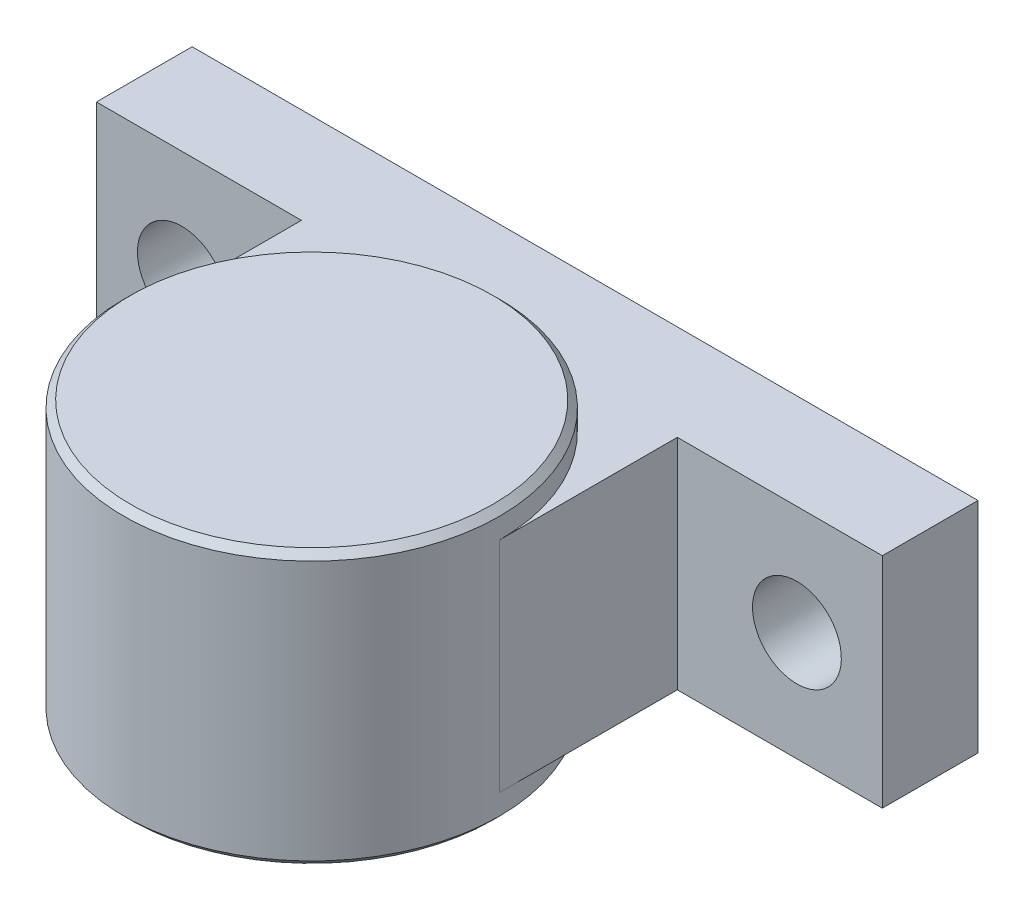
ISO-10303-21;
HEADER;
FILE_DESCRIPTION(('STEP AP214'),'2;1');
FILE_NAME('part.step','',(''),(''),'','','');
FILE_SCHEMA(('AUTOMOTIVE_DESIGN { 1 0 10303 214 1 1 1 1 }'));
ENDSEC;
DATA;
#1=APPLICATION_CONTEXT('core data for automotive mechanical design processes');
#2=APPLICATION_PROTOCOL_DEFINITION('international standard','automotive_design',2000,#1);
#3=PRODUCT_CONTEXT('',#1,'mechanical');
#4=PRODUCT('Part','Part','',(#3));
#5=PRODUCT_RELATED_PRODUCT_CATEGORY('part','',(#4));
#6=PRODUCT_DEFINITION_FORMATION('','',#4);
#7=PRODUCT_DEFINITION_CONTEXT('part definition',#1,'design');
#8=PRODUCT_DEFINITION('design','',#6,#7);
#9=PRODUCT_DEFINITION_SHAPE('','',#8);
#10=(LENGTH_UNIT() NAMED_UNIT(*) SI_UNIT(.MILLI.,.METRE.));
#11=(NAMED_UNIT(*) PLANE_ANGLE_UNIT() SI_UNIT($,.RADIAN.));
#12=(NAMED_UNIT(*) SI_UNIT($,.STERADIAN.) SOLID_ANGLE_UNIT());
#13=UNCERTAINTY_MEASURE_WITH_UNIT(LENGTH_MEASURE(1.E-05),#10,'distance_accuracy_value','');
#14=(GEOMETRIC_REPRESENTATION_CONTEXT(3) GLOBAL_UNCERTAINTY_ASSIGNED_CONTEXT((#13)) GLOBAL_UNIT_ASSIGNED_CONTEXT((#10,
#11,#12)) REPRESENTATION_CONTEXT('',''));
#15=CARTESIAN_POINT('',(0.,0.,0.));
#16=DIRECTION('',(0.,0.,1.));
#17=DIRECTION('',(1.,0.,0.));
#18=AXIS2_PLACEMENT_3D('',#15,#16,#17);
#19=CARTESIAN_POINT('',(-12.5,16.,14.));
#20=DIRECTION('',(0.,0.,1.));
#21=DIRECTION('',(0.,-1.,0.));
#22=AXIS2_PLACEMENT_3D('',#19,#20,#21);
#23=PLANE('',#22);
#24=CARTESIAN_POINT('',(0.,0.,14.));
#25=DIRECTION('',(0.,0.,1.));
#26=DIRECTION('',(0.,-1.,0.));
#27=AXIS2_PLACEMENT_3D('',#24,#25,#26);
#28=CIRCLE('',#27,6.5);
#29=CARTESIAN_POINT('',(0.,-6.5,14.));
#30=VERTEX_POINT('',#29);
#31=EDGE_CURVE('E126',#30,#30,#28,.T.);
#32=ORIENTED_EDGE('',*,*,#31,.F.);
#33=EDGE_LOOP('',(#32));
#34=FACE_BOUND('',#33,.T.);
#35=DIRECTION('',(-1.,0.,0.));
#36=VECTOR('',#35,1.);
#37=CARTESIAN_POINT('',(102.5,-16.,14.));
#38=LINE('',#37,#36);
#39=CARTESIAN_POINT('',(17.5,-16.,14.));
#40=VERTEX_POINT('',#39);
#41=CARTESIAN_POINT('',(-12.5,-16.,14.));
#42=VERTEX_POINT('',#41);
#43=EDGE_CURVE('E144',#40,#42,#38,.T.);
#44=ORIENTED_EDGE('',*,*,#43,.F.);
#45=DIRECTION('',(0.,1.,0.));
#46=VECTOR('',#45,1.);
#47=CARTESIAN_POINT('',(17.5,-16.,14.));
#48=LINE('',#47,#46);
#49=CARTESIAN_POINT('',(17.5,16.,14.));
#50=VERTEX_POINT('',#49);
#51=EDGE_CURVE('E97',#40,#50,#48,.T.);
#52=ORIENTED_EDGE('',*,*,#51,.T.);
#53=DIRECTION('',(1.,0.,0.));
#54=VECTOR('',#53,1.);
#55=CARTESIAN_POINT('',(-12.5,16.,14.));
#56=LINE('',#55,#54);
#57=CARTESIAN_POINT('',(-12.5,16.,14.));
#58=VERTEX_POINT('',#57);
#59=EDGE_CURVE('E162',#58,#50,#56,.T.);
#60=ORIENTED_EDGE('',*,*,#59,.F.);
#61=DIRECTION('',(0.,-1.,0.));
#62=VECTOR('',#61,1.);
#63=CARTESIAN_POINT('',(-12.5,16.,14.));
#64=LINE('',#63,#62);
#65=EDGE_CURVE('E141',#58,#42,#64,.T.);
#66=ORIENTED_EDGE('',*,*,#65,.T.);
#67=EDGE_LOOP('',(#44,#52,#60,#66));
#68=FACE_BOUND('',#67,.T.);
#69=ADVANCED_FACE('F14',(#34,#68),#23,.T.);
#70=DIRECTION('',(0.,1.,0.));
#71=VECTOR('',#70,1.);
#72=CARTESIAN_POINT('',(72.5,-16.,14.));
#73=LINE('',#72,#71);
#74=CARTESIAN_POINT('',(72.5,-16.,14.));
#75=VERTEX_POINT('',#74);
#76=CARTESIAN_POINT('',(72.5,16.,14.));
#77=VERTEX_POINT('',#76);
#78=EDGE_CURVE('E109',#75,#77,#73,.T.);
#79=ORIENTED_EDGE('',*,*,#78,.F.);
#80=CARTESIAN_POINT('',(102.5,-16.,14.));
#81=VERTEX_POINT('',#80);
#82=EDGE_CURVE('E153',#81,#75,#38,.T.);
#83=ORIENTED_EDGE('',*,*,#82,.F.);
#84=DIRECTION('',(0.,1.,0.));
#85=VECTOR('',#84,1.);
#86=CARTESIAN_POINT('',(102.5,-16.,14.));
#87=LINE('',#86,#85);
#88=CARTESIAN_POINT('',(102.5,16.,14.));
#89=VERTEX_POINT('',#88);
#90=EDGE_CURVE('E147',#81,#89,#87,.T.);
#91=ORIENTED_EDGE('',*,*,#90,.T.);
#92=EDGE_CURVE('E166',#77,#89,#56,.T.);
#93=ORIENTED_EDGE('',*,*,#92,.F.);
#94=EDGE_LOOP('',(#79,#83,#91,#93));
#95=FACE_BOUND('',#94,.T.);
#96=CARTESIAN_POINT('',(90.,0.,14.));
#97=DIRECTION('',(0.,0.,-1.));
#98=DIRECTION('',(0.,1.,0.));
#99=AXIS2_PLACEMENT_3D('',#96,#97,#98);
#100=CIRCLE('',#99,6.5);
#101=CARTESIAN_POINT('',(90.,6.5,14.));
#102=VERTEX_POINT('',#101);
#103=EDGE_CURVE('E120',#102,#102,#100,.T.);
#104=ORIENTED_EDGE('',*,*,#103,.T.);
#105=EDGE_LOOP('',(#104));
#106=FACE_BOUND('',#105,.T.);
#107=ADVANCED_FACE('F175',(#95,#106),#23,.T.);
#108=CARTESIAN_POINT('',(-12.5,16.,0.));
#109=DIRECTION('',(0.,0.,1.));
#110=DIRECTION('',(0.,-1.,0.));
#111=AXIS2_PLACEMENT_3D('',#108,#109,#110);
#112=PLANE('',#111);
#113=CARTESIAN_POINT('',(90.,0.,0.));
#114=DIRECTION('',(0.,0.,-1.));
#115=DIRECTION('',(0.,1.,0.));
#116=AXIS2_PLACEMENT_3D('',#113,#114,#115);
#117=CIRCLE('',#116,6.5);
#118=CARTESIAN_POINT('',(90.,6.5,0.));
#119=VERTEX_POINT('',#118);
#120=EDGE_CURVE('E117',#119,#119,#117,.T.);
#121=ORIENTED_EDGE('',*,*,#120,.F.);
#122=EDGE_LOOP('',(#121));
#123=FACE_BOUND('',#122,.T.);
#124=DIRECTION('',(0.,-1.,0.));
#125=VECTOR('',#124,1.);
#126=CARTESIAN_POINT('',(-12.5,16.,0.));
#127=LINE('',#126,#125);
#128=CARTESIAN_POINT('',(-12.5,16.,0.));
#129=VERTEX_POINT('',#128);
#130=CARTESIAN_POINT('',(-12.5,-16.,0.));
#131=VERTEX_POINT('',#130);
#132=EDGE_CURVE('E129',#129,#131,#127,.T.);
#133=ORIENTED_EDGE('',*,*,#132,.F.);
#134=DIRECTION('',(1.,0.,0.));
#135=VECTOR('',#134,1.);
#136=CARTESIAN_POINT('',(-12.5,16.,0.));
#137=LINE('',#136,#135);
#138=CARTESIAN_POINT('',(102.5,16.,0.));
#139=VERTEX_POINT('',#138);
#140=EDGE_CURVE('E138',#129,#139,#137,.T.);
#141=ORIENTED_EDGE('',*,*,#140,.T.);
#142=DIRECTION('',(0.,1.,0.));
#143=VECTOR('',#142,1.);
#144=CARTESIAN_POINT('',(102.5,-16.,0.));
#145=LINE('',#144,#143);
#146=CARTESIAN_POINT('',(102.5,-16.,0.));
#147=VERTEX_POINT('',#146);
#148=EDGE_CURVE('E135',#147,#139,#145,.T.);
#149=ORIENTED_EDGE('',*,*,#148,.F.);
#150=DIRECTION('',(-1.,0.,0.));
#151=VECTOR('',#150,1.);
#152=CARTESIAN_POINT('',(102.5,-16.,0.));
#153=LINE('',#152,#151);
#154=EDGE_CURVE('E132',#147,#131,#153,.T.);
#155=ORIENTED_EDGE('',*,*,#154,.T.);
#156=EDGE_LOOP('',(#133,#141,#149,#155));
#157=FACE_BOUND('',#156,.T.);
#158=CARTESIAN_POINT('',(0.,0.,0.));
#159=DIRECTION('',(0.,0.,1.));
#160=DIRECTION('',(0.,-1.,0.));
#161=AXIS2_PLACEMENT_3D('',#158,#159,#160);
#162=CIRCLE('',#161,6.5);
#163=CARTESIAN_POINT('',(0.,-6.5,0.));
#164=VERTEX_POINT('',#163);
#165=EDGE_CURVE('E123',#164,#164,#162,.T.);
#166=ORIENTED_EDGE('',*,*,#165,.T.);
#167=EDGE_LOOP('',(#166));
#168=FACE_BOUND('',#167,.T.);
#169=ADVANCED_FACE('F184',(#123,#157,#168),#112,.F.);
#170=CARTESIAN_POINT('',(-12.5,16.,14.));
#171=DIRECTION('',(1.,0.,0.));
#172=DIRECTION('',(0.,1.,0.));
#173=AXIS2_PLACEMENT_3D('',#170,#171,#172);
#174=PLANE('',#173);
#175=DIRECTION('',(0.,0.,-1.));
#176=VECTOR('',#175,1.);
#177=CARTESIAN_POINT('',(-12.5,-16.,14.));
#178=LINE('',#177,#176);
#179=EDGE_CURVE('E155',#42,#131,#178,.T.);
#180=ORIENTED_EDGE('',*,*,#179,.F.);
#181=ORIENTED_EDGE('',*,*,#65,.F.);
#182=DIRECTION('',(0.,0.,-1.));
#183=VECTOR('',#182,1.);
#184=CARTESIAN_POINT('',(-12.5,16.,14.));
#185=LINE('',#184,#183);
#186=EDGE_CURVE('E37',#58,#129,#185,.T.);
#187=ORIENTED_EDGE('',*,*,#186,.T.);
#188=ORIENTED_EDGE('',*,*,#132,.T.);
#189=EDGE_LOOP('',(#180,#181,#187,#188));
#190=FACE_BOUND('',#189,.T.);
#191=ADVANCED_FACE('F188',(#190),#174,.F.);
#192=CARTESIAN_POINT('',(102.5,-16.,14.));
#193=DIRECTION('',(0.,-1.,0.));
#194=DIRECTION('',(1.,0.,0.));
#195=AXIS2_PLACEMENT_3D('',#192,#193,#194);
#196=PLANE('',#195);
#197=CARTESIAN_POINT('',(45.,-16.,40.));
#198=DIRECTION('',(0.,-1.,0.));
#199=DIRECTION('',(1.,0.,0.));
#200=AXIS2_PLACEMENT_3D('',#197,#198,#199);
#201=CIRCLE('',#200,27.5);
#202=CARTESIAN_POINT('',(17.5,-16.,40.));
#203=VERTEX_POINT('',#202);
#204=CARTESIAN_POINT('',(72.5,-16.,40.));
#205=VERTEX_POINT('',#204);
#206=EDGE_CURVE('E82',#203,#205,#201,.T.);
#207=ORIENTED_EDGE('',*,*,#206,.F.);
#208=DIRECTION('',(0.,0.,-1.));
#209=VECTOR('',#208,1.);
#210=CARTESIAN_POINT('',(17.5,-16.,40.));
#211=LINE('',#210,#209);
#212=EDGE_CURVE('E91',#203,#40,#211,.T.);
#213=ORIENTED_EDGE('',*,*,#212,.T.);
#214=ORIENTED_EDGE('',*,*,#43,.T.);
#215=ORIENTED_EDGE('',*,*,#179,.T.);
#216=ORIENTED_EDGE('',*,*,#154,.F.);
#217=DIRECTION('',(0.,0.,-1.));
#218=VECTOR('',#217,1.);
#219=CARTESIAN_POINT('',(102.5,-16.,14.));
#220=LINE('',#219,#218);
#221=EDGE_CURVE('E158',#81,#147,#220,.T.);
#222=ORIENTED_EDGE('',*,*,#221,.F.);
#223=ORIENTED_EDGE('',*,*,#82,.T.);
#224=DIRECTION('',(0.,0.,-1.));
#225=VECTOR('',#224,1.);
#226=CARTESIAN_POINT('',(72.5,-16.,40.));
#227=LINE('',#226,#225);
#228=EDGE_CURVE('E94',#205,#75,#227,.T.);
#229=ORIENTED_EDGE('',*,*,#228,.F.);
#230=EDGE_LOOP('',(#207,#213,#214,#215,#216,#222,#223,#229));
#231=FACE_BOUND('',#230,.T.);
#232=ADVANCED_FACE('F16',(#231),#196,.T.);
#233=CARTESIAN_POINT('',(102.5,-16.,14.));
#234=DIRECTION('',(-1.,0.,0.));
#235=DIRECTION('',(0.,-1.,0.));
#236=AXIS2_PLACEMENT_3D('',#233,#234,#235);
#237=PLANE('',#236);
#238=DIRECTION('',(0.,0.,-1.));
#239=VECTOR('',#238,1.);
#240=CARTESIAN_POINT('',(102.5,16.,14.));
#241=LINE('',#240,#239);
#242=EDGE_CURVE('E160',#89,#139,#241,.T.);
#243=ORIENTED_EDGE('',*,*,#242,.F.);
#244=ORIENTED_EDGE('',*,*,#90,.F.);
#245=ORIENTED_EDGE('',*,*,#221,.T.);
#246=ORIENTED_EDGE('',*,*,#148,.T.);
#247=EDGE_LOOP('',(#243,#244,#245,#246));
#248=FACE_BOUND('',#247,.T.);
#249=ADVANCED_FACE('F178',(#248),#237,.F.);
#250=CARTESIAN_POINT('',(-12.5,16.,14.));
#251=DIRECTION('',(0.,1.,0.));
#252=DIRECTION('',(-1.,0.,0.));
#253=AXIS2_PLACEMENT_3D('',#250,#251,#252);
#254=PLANE('',#253);
#255=CARTESIAN_POINT('',(45.,16.,40.));
#256=DIRECTION('',(0.,1.,0.));
#257=DIRECTION('',(-1.,0.,0.));
#258=AXIS2_PLACEMENT_3D('',#255,#256,#257);
#259=CIRCLE('',#258,27.5);
#260=CARTESIAN_POINT('',(72.5,16.,40.));
#261=VERTEX_POINT('',#260);
#262=CARTESIAN_POINT('',(17.5,16.,40.));
#263=VERTEX_POINT('',#262);
#264=EDGE_CURVE('E85',#261,#263,#259,.T.);
#265=ORIENTED_EDGE('',*,*,#264,.F.);
#266=DIRECTION('',(0.,0.,-1.));
#267=VECTOR('',#266,1.);
#268=CARTESIAN_POINT('',(72.5,16.,40.));
#269=LINE('',#268,#267);
#270=EDGE_CURVE('E100',#261,#77,#269,.T.);
#271=ORIENTED_EDGE('',*,*,#270,.T.);
#272=ORIENTED_EDGE('',*,*,#92,.T.);
#273=ORIENTED_EDGE('',*,*,#242,.T.);
#274=ORIENTED_EDGE('',*,*,#140,.F.);
#275=ORIENTED_EDGE('',*,*,#186,.F.);
#276=ORIENTED_EDGE('',*,*,#59,.T.);
#277=DIRECTION('',(0.,0.,-1.));
#278=VECTOR('',#277,1.);
#279=CARTESIAN_POINT('',(17.5,16.,40.));
#280=LINE('',#279,#278);
#281=EDGE_CURVE('E29',#263,#50,#280,.T.);
#282=ORIENTED_EDGE('',*,*,#281,.F.);
#283=EDGE_LOOP('',(#265,#271,#272,#273,#274,#275,#276,#282));
#284=FACE_BOUND('',#283,.T.);
#285=ADVANCED_FACE('F181',(#284),#254,.T.);
#286=CARTESIAN_POINT('',(0.,0.,14.));
#287=DIRECTION('',(0.,0.,-1.));
#288=DIRECTION('',(0.,1.,0.));
#289=AXIS2_PLACEMENT_3D('',#286,#287,#288);
#290=CYLINDRICAL_SURFACE('',#289,6.5);
#291=ORIENTED_EDGE('',*,*,#31,.T.);
#292=EDGE_LOOP('',(#291));
#293=FACE_BOUND('',#292,.T.);
#294=ORIENTED_EDGE('',*,*,#165,.F.);
#295=EDGE_LOOP('',(#294));
#296=FACE_BOUND('',#295,.T.);
#297=ADVANCED_FACE('F205',(#293,#296),#290,.F.);
#298=CARTESIAN_POINT('',(90.,0.,14.));
#299=DIRECTION('',(0.,0.,-1.));
#300=DIRECTION('',(0.,1.,0.));
#301=AXIS2_PLACEMENT_3D('',#298,#299,#300);
#302=CYLINDRICAL_SURFACE('',#301,6.5);
#303=ORIENTED_EDGE('',*,*,#103,.F.);
#304=EDGE_LOOP('',(#303));
#305=FACE_BOUND('',#304,.T.);
#306=ORIENTED_EDGE('',*,*,#120,.T.);
#307=EDGE_LOOP('',(#306));
#308=FACE_BOUND('',#307,.T.);
#309=ADVANCED_FACE('F259',(#305,#308),#302,.F.);
#310=CARTESIAN_POINT('',(72.5,16.,40.));
#311=DIRECTION('',(-1.,0.,0.));
#312=DIRECTION('',(0.,-1.,0.));
#313=AXIS2_PLACEMENT_3D('',#310,#311,#312);
#314=PLANE('',#313);
#315=DIRECTION('',(0.,1.,0.));
#316=VECTOR('',#315,1.);
#317=CARTESIAN_POINT('',(72.5,-16.,40.));
#318=LINE('',#317,#316);
#319=EDGE_CURVE('E98',#205,#261,#318,.T.);
#320=ORIENTED_EDGE('',*,*,#319,.F.);
#321=ORIENTED_EDGE('',*,*,#228,.T.);
#322=ORIENTED_EDGE('',*,*,#78,.T.);
#323=ORIENTED_EDGE('',*,*,#270,.F.);
#324=EDGE_LOOP('',(#320,#321,#322,#323));
#325=FACE_BOUND('',#324,.T.);
#326=ADVANCED_FACE('F266',(#325),#314,.F.);
#327=CARTESIAN_POINT('',(17.5,16.,40.));
#328=DIRECTION('',(-1.,0.,0.));
#329=DIRECTION('',(0.,-1.,0.));
#330=AXIS2_PLACEMENT_3D('',#327,#328,#329);
#331=PLANE('',#330);
#332=DIRECTION('',(0.,1.,0.));
#333=VECTOR('',#332,1.);
#334=CARTESIAN_POINT('',(17.5,-16.,40.));
#335=LINE('',#334,#333);
#336=EDGE_CURVE('E79',#203,#263,#335,.T.);
#337=ORIENTED_EDGE('',*,*,#336,.T.);
#338=ORIENTED_EDGE('',*,*,#281,.T.);
#339=ORIENTED_EDGE('',*,*,#51,.F.);
#340=ORIENTED_EDGE('',*,*,#212,.F.);
#341=EDGE_LOOP('',(#337,#338,#339,#340));
#342=FACE_BOUND('',#341,.T.);
#343=ADVANCED_FACE('F96',(#342),#331,.T.);
#344=CARTESIAN_POINT('',(45.,20.,40.));
#345=DIRECTION('',(0.,-1.,0.));
#346=DIRECTION('',(1.,0.,0.));
#347=AXIS2_PLACEMENT_3D('',#344,#345,#346);
#348=CYLINDRICAL_SURFACE('',#347,27.5);
#349=CARTESIAN_POINT('',(45.,-19.,40.));
#350=DIRECTION('',(0.,-1.,0.));
#351=DIRECTION('',(1.,0.,0.));
#352=AXIS2_PLACEMENT_3D('',#349,#350,#351);
#353=CIRCLE('',#352,27.5);
#354=CARTESIAN_POINT('',(72.5,-19.,40.));
#355=VERTEX_POINT('',#354);
#356=EDGE_CURVE('E22',#355,#355,#353,.F.);
#357=ORIENTED_EDGE('',*,*,#356,.T.);
#358=EDGE_LOOP('',(#357));
#359=FACE_BOUND('',#358,.T.);
#360=CARTESIAN_POINT('',(45.,19.,40.));
#361=DIRECTION('',(0.,-1.,0.));
#362=DIRECTION('',(1.,0.,0.));
#363=AXIS2_PLACEMENT_3D('',#360,#361,#362);
#364=CIRCLE('',#363,27.5);
#365=CARTESIAN_POINT('',(72.5,19.,40.));
#366=VERTEX_POINT('',#365);
#367=EDGE_CURVE('E345',#366,#366,#364,.T.);
#368=ORIENTED_EDGE('',*,*,#367,.T.);
#369=EDGE_LOOP('',(#368));
#370=FACE_BOUND('',#369,.T.);
#371=ORIENTED_EDGE('',*,*,#319,.T.);
#372=ORIENTED_EDGE('',*,*,#264,.T.);
#373=ORIENTED_EDGE('',*,*,#336,.F.);
#374=ORIENTED_EDGE('',*,*,#206,.T.);
#375=EDGE_LOOP('',(#371,#372,#373,#374));
#376=FACE_BOUND('',#375,.T.);
#377=ADVANCED_FACE('F81',(#359,#370,#376),#348,.T.);
#378=CARTESIAN_POINT('',(45.,20.,40.));
#379=DIRECTION('',(0.,-1.,0.));
#380=DIRECTION('',(1.,0.,0.));
#381=AXIS2_PLACEMENT_3D('',#378,#379,#380);
#382=PLANE('',#381);
#383=CARTESIAN_POINT('',(45.,20.,40.));
#384=DIRECTION('',(0.,-1.,0.));
#385=DIRECTION('',(1.,0.,0.));
#386=AXIS2_PLACEMENT_3D('',#383,#384,#385);
#387=CIRCLE('',#386,26.5);
#388=CARTESIAN_POINT('',(71.5,20.,40.));
#389=VERTEX_POINT('',#388);
#390=EDGE_CURVE('E9',#389,#389,#387,.F.);
#391=ORIENTED_EDGE('',*,*,#390,.T.);
#392=EDGE_LOOP('',(#391));
#393=FACE_BOUND('',#392,.T.);
#394=ADVANCED_FACE('F287',(#393),#382,.F.);
#395=CARTESIAN_POINT('',(45.,-20.,40.));
#396=DIRECTION('',(0.,-1.,0.));
#397=DIRECTION('',(1.,0.,0.));
#398=AXIS2_PLACEMENT_3D('',#395,#396,#397);
#399=PLANE('',#398);
#400=CARTESIAN_POINT('',(45.,-20.,40.));
#401=DIRECTION('',(0.,-1.,0.));
#402=DIRECTION('',(1.,0.,0.));
#403=AXIS2_PLACEMENT_3D('',#400,#401,#402);
#404=CIRCLE('',#403,26.5);
#405=CARTESIAN_POINT('',(71.5,-20.,40.));
#406=VERTEX_POINT('',#405);
#407=EDGE_CURVE('E157',#406,#406,#404,.T.);
#408=ORIENTED_EDGE('',*,*,#407,.T.);
#409=EDGE_LOOP('',(#408));
#410=FACE_BOUND('',#409,.T.);
#411=ADVANCED_FACE('F295',(#410),#399,.T.);
#412=CARTESIAN_POINT('',(45.,-20.,40.));
#413=DIRECTION('',(0.,1.,0.));
#414=DIRECTION('',(-1.,0.,0.));
#415=AXIS2_PLACEMENT_3D('',#412,#413,#414);
#416=CONICAL_SURFACE('',#415,26.5,0.785398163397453);
#417=ORIENTED_EDGE('',*,*,#356,.F.);
#418=EDGE_LOOP('',(#417));
#419=FACE_BOUND('',#418,.T.);
#420=ORIENTED_EDGE('',*,*,#407,.F.);
#421=EDGE_LOOP('',(#420));
#422=FACE_BOUND('',#421,.T.);
#423=ADVANCED_FACE('F303',(#419,#422),#416,.T.);
#424=CARTESIAN_POINT('',(45.,19.,40.));
#425=DIRECTION('',(0.,-1.,0.));
#426=DIRECTION('',(1.,0.,0.));
#427=AXIS2_PLACEMENT_3D('',#424,#425,#426);
#428=CONICAL_SURFACE('',#427,27.5,0.785398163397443);
#429=ORIENTED_EDGE('',*,*,#390,.F.);
#430=EDGE_LOOP('',(#429));
#431=FACE_BOUND('',#430,.T.);
#432=ORIENTED_EDGE('',*,*,#367,.F.);
#433=EDGE_LOOP('',(#432));
#434=FACE_BOUND('',#433,.T.);
#435=ADVANCED_FACE('F311',(#431,#434),#428,.T.);
#436=CLOSED_SHELL('',(#69,#107,#169,#191,#232,#249,#285,#297,#309,#326,#343,#377,#394,#411,#423,#435));
#437=MANIFOLD_SOLID_BREP('B1',#436);
#438=ADVANCED_BREP_SHAPE_REPRESENTATION('',(#18,#437),#14);
#439=SHAPE_DEFINITION_REPRESENTATION(#9,#438);
ENDSEC;
END-ISO-10303-21;
